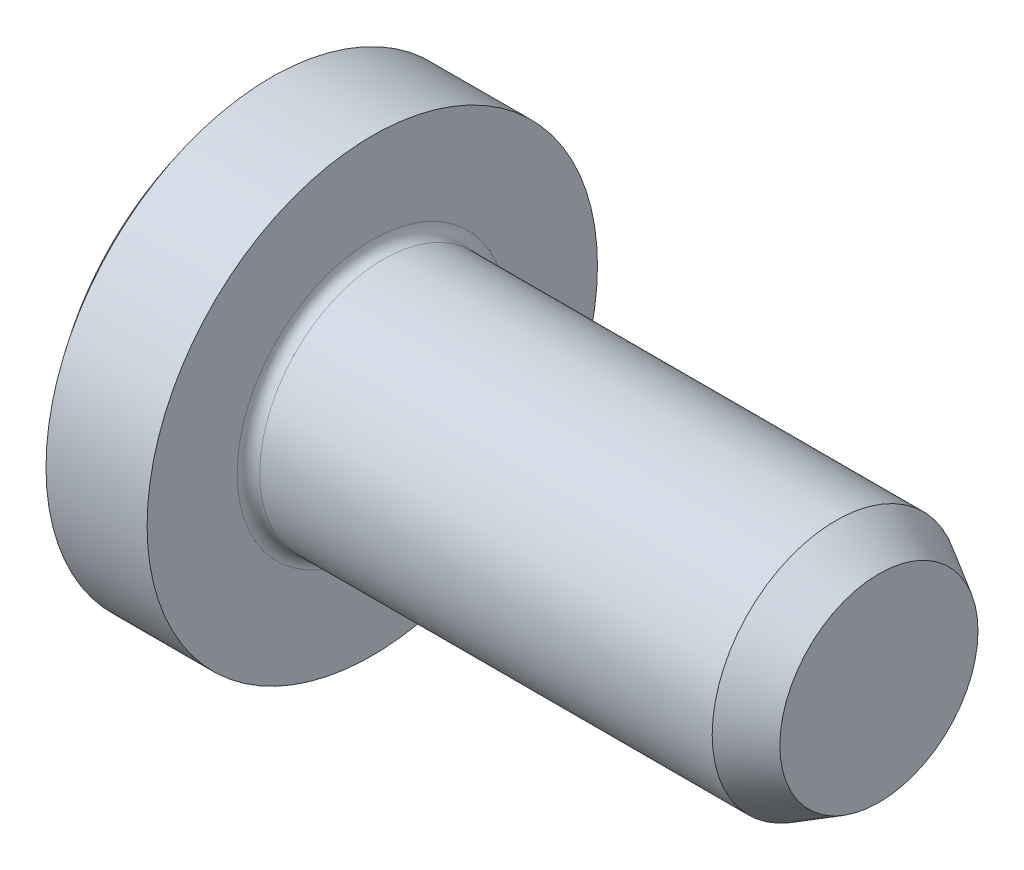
from build123d import *

# Parameters (mm, degrees)
CHAMFER1_SIZE      = 0.22
CHAMFER1_SIZE2     = 0.381051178
CUT_EXTRUDE1_DEPTH = 0.8
CUT_EXTRUDE1_TAPER = 6
FILLET1_R          = 0.1


with BuildPart() as part:
    # Sketch1 → Revolve1 (revolve)
    with BuildSketch(Plane.XY, mode=Mode.PRIVATE) as revolve1_sk:
        with BuildLine():
            Line((0, 2), (-0.897999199, 2))
            ThreePointArc((-0.897999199, 2), (-1.419403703, 1.059811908), (-1.6, 0))
            Line((-1.6, 0), (4.5, 0))
            Line((4.5, 0), (4.5, 1.1))
            Line((4.5, 1.1), (0, 1.1))
            Line((0, 1.1), (0, 2))
        make_face()
    revolve(revolve1_sk.sketch.rotate(Axis((0, 0, 0), (1, 0, 0)), 90), axis=Axis((0, 0, 0), (1, 0, 0)))

    # Chamfer1
    chamfer1_edges = [part.edges().sort_by_distance(p)[0] for p in [
        (4.5, 0, -1.1),
    ]]
    chamfer1_side = [part.faces().sort_by_distance(p)[0] for p in [
        (4.5, 0, 0),
    ]]
    chamfer(chamfer1_edges, length=CHAMFER1_SIZE, length2=CHAMFER1_SIZE2, reference=chamfer1_side[0])

    # Sketch3 → Cut-Extrude1 (cut)
    with BuildSketch(Plane(origin=(-1.6, 0, 0), x_dir=(0, 0, -1), z_dir=(1, 0, 0))):
        Polygon((-0.2375, 0.95), (-0.1425, 0.57), (-0.29897586, 0.29897586), (-0.57, 0.1425), (-0.95, 0.2375), (-0.95, -0.2375), (-0.57, -0.1425), (-0.29897586, -0.29897586), (-0.1425, -0.57), (-0.2375, -0.95), (0.2375, -0.95), (0.1425, -0.57), (0.29897586, -0.29897586), (0.57, -0.1425), (0.95, -0.2375), (0.95, 0.2375), (0.57, 0.1425), (0.29897586, 0.29897586), (0.1425, 0.57), (0.2375, 0.95), align=None)
    extrude(amount=CUT_EXTRUDE1_DEPTH, taper=CUT_EXTRUDE1_TAPER, mode=Mode.SUBTRACT)

    # Fillet1
    fillet1_edges = [part.edges().sort_by_distance(p)[0] for p in [
        (0, 0, -1.1),
    ]]
    fillet(fillet1_edges, radius=FILLET1_R)


solid = part.part
